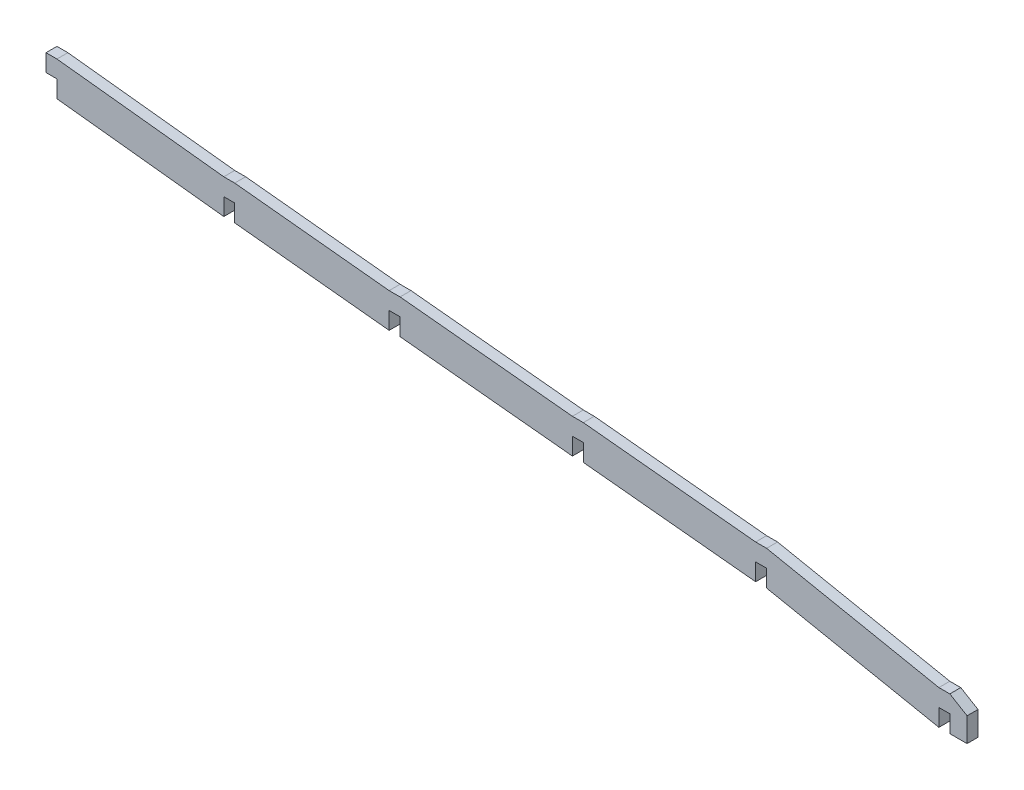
ISO-10303-21;
HEADER;
FILE_DESCRIPTION(('STEP AP214'),'2;1');
FILE_NAME('part.step','',(''),(''),'','','');
FILE_SCHEMA(('AUTOMOTIVE_DESIGN { 1 0 10303 214 1 1 1 1 }'));
ENDSEC;
DATA;
#1=APPLICATION_CONTEXT('core data for automotive mechanical design processes');
#2=APPLICATION_PROTOCOL_DEFINITION('international standard','automotive_design',2000,#1);
#3=PRODUCT_CONTEXT('',#1,'mechanical');
#4=PRODUCT('Part','Part','',(#3));
#5=PRODUCT_RELATED_PRODUCT_CATEGORY('part','',(#4));
#6=PRODUCT_DEFINITION_FORMATION('','',#4);
#7=PRODUCT_DEFINITION_CONTEXT('part definition',#1,'design');
#8=PRODUCT_DEFINITION('design','',#6,#7);
#9=PRODUCT_DEFINITION_SHAPE('','',#8);
#10=(LENGTH_UNIT() NAMED_UNIT(*) SI_UNIT(.MILLI.,.METRE.));
#11=(NAMED_UNIT(*) PLANE_ANGLE_UNIT() SI_UNIT($,.RADIAN.));
#12=(NAMED_UNIT(*) SI_UNIT($,.STERADIAN.) SOLID_ANGLE_UNIT());
#13=UNCERTAINTY_MEASURE_WITH_UNIT(LENGTH_MEASURE(1.E-05),#10,'distance_accuracy_value','');
#14=(GEOMETRIC_REPRESENTATION_CONTEXT(3) GLOBAL_UNCERTAINTY_ASSIGNED_CONTEXT((#13)) GLOBAL_UNIT_ASSIGNED_CONTEXT((#10,
#11,#12)) REPRESENTATION_CONTEXT('',''));
#15=CARTESIAN_POINT('',(0.,0.,0.));
#16=DIRECTION('',(0.,0.,1.));
#17=DIRECTION('',(1.,0.,0.));
#18=AXIS2_PLACEMENT_3D('',#15,#16,#17);
#19=CARTESIAN_POINT('',(0.,45.,3.175));
#20=DIRECTION('',(-1.,0.,0.));
#21=DIRECTION('',(0.,-1.,0.));
#22=AXIS2_PLACEMENT_3D('',#19,#20,#21);
#23=PLANE('',#22);
#24=DIRECTION('',(0.,1.,0.));
#25=VECTOR('',#24,1.);
#26=CARTESIAN_POINT('',(0.,45.,0.));
#27=LINE('',#26,#25);
#28=CARTESIAN_POINT('',(0.,40.,0.));
#29=VERTEX_POINT('',#28);
#30=CARTESIAN_POINT('',(0.,45.,0.));
#31=VERTEX_POINT('',#30);
#32=EDGE_CURVE('E303',#29,#31,#27,.T.);
#33=ORIENTED_EDGE('',*,*,#32,.T.);
#34=DIRECTION('',(0.,0.,-1.));
#35=VECTOR('',#34,1.);
#36=CARTESIAN_POINT('',(0.,45.,3.175));
#37=LINE('',#36,#35);
#38=CARTESIAN_POINT('',(0.,45.,3.175));
#39=VERTEX_POINT('',#38);
#40=EDGE_CURVE('E11',#39,#31,#37,.T.);
#41=ORIENTED_EDGE('',*,*,#40,.F.);
#42=DIRECTION('',(0.,1.,0.));
#43=VECTOR('',#42,1.);
#44=CARTESIAN_POINT('',(0.,45.,3.175));
#45=LINE('',#44,#43);
#46=CARTESIAN_POINT('',(0.,40.,3.175));
#47=VERTEX_POINT('',#46);
#48=EDGE_CURVE('E375',#47,#39,#45,.T.);
#49=ORIENTED_EDGE('',*,*,#48,.F.);
#50=DIRECTION('',(0.,0.,-1.));
#51=VECTOR('',#50,1.);
#52=CARTESIAN_POINT('',(0.,40.,3.175));
#53=LINE('',#52,#51);
#54=EDGE_CURVE('E299',#47,#29,#53,.T.);
#55=ORIENTED_EDGE('',*,*,#54,.T.);
#56=EDGE_LOOP('',(#33,#41,#49,#55));
#57=FACE_BOUND('',#56,.T.);
#58=ADVANCED_FACE('F33',(#57),#23,.F.);
#59=CARTESIAN_POINT('',(0.,45.,3.175));
#60=DIRECTION('',(0.,1.,0.));
#61=DIRECTION('',(0.,0.,1.));
#62=AXIS2_PLACEMENT_3D('',#59,#60,#61);
#63=PLANE('',#62);
#64=DIRECTION('',(1.,0.,0.));
#65=VECTOR('',#64,1.);
#66=CARTESIAN_POINT('',(0.,45.,0.));
#67=LINE('',#66,#65);
#68=CARTESIAN_POINT('',(3.175,45.,0.));
#69=VERTEX_POINT('',#68);
#70=EDGE_CURVE('E306',#31,#69,#67,.T.);
#71=ORIENTED_EDGE('',*,*,#70,.T.);
#72=DIRECTION('',(0.,0.,-1.));
#73=VECTOR('',#72,1.);
#74=CARTESIAN_POINT('',(3.175,45.,3.175));
#75=LINE('',#74,#73);
#76=CARTESIAN_POINT('',(3.175,45.,3.175));
#77=VERTEX_POINT('',#76);
#78=EDGE_CURVE('E41',#77,#69,#75,.T.);
#79=ORIENTED_EDGE('',*,*,#78,.F.);
#80=DIRECTION('',(1.,0.,0.));
#81=VECTOR('',#80,1.);
#82=CARTESIAN_POINT('',(0.,45.,3.175));
#83=LINE('',#82,#81);
#84=EDGE_CURVE('E179',#39,#77,#83,.T.);
#85=ORIENTED_EDGE('',*,*,#84,.F.);
#86=ORIENTED_EDGE('',*,*,#40,.T.);
#87=EDGE_LOOP('',(#71,#79,#85,#86));
#88=FACE_BOUND('',#87,.T.);
#89=ADVANCED_FACE('F578',(#88),#63,.F.);
#90=CARTESIAN_POINT('',(3.175,45.,3.175));
#91=DIRECTION('',(1.,0.,0.));
#92=DIRECTION('',(0.,0.,-1.));
#93=AXIS2_PLACEMENT_3D('',#90,#91,#92);
#94=PLANE('',#93);
#95=DIRECTION('',(0.,-1.,0.));
#96=VECTOR('',#95,1.);
#97=CARTESIAN_POINT('',(3.175,45.,0.));
#98=LINE('',#97,#96);
#99=CARTESIAN_POINT('',(3.175,40.,0.));
#100=VERTEX_POINT('',#99);
#101=EDGE_CURVE('E308',#69,#100,#98,.T.);
#102=ORIENTED_EDGE('',*,*,#101,.T.);
#103=DIRECTION('',(0.,0.,-1.));
#104=VECTOR('',#103,1.);
#105=CARTESIAN_POINT('',(3.175,40.,3.175));
#106=LINE('',#105,#104);
#107=CARTESIAN_POINT('',(3.175,40.,3.175));
#108=VERTEX_POINT('',#107);
#109=EDGE_CURVE('E469',#108,#100,#106,.T.);
#110=ORIENTED_EDGE('',*,*,#109,.F.);
#111=DIRECTION('',(0.,-1.,0.));
#112=VECTOR('',#111,1.);
#113=CARTESIAN_POINT('',(3.175,45.,3.175));
#114=LINE('',#113,#112);
#115=EDGE_CURVE('E477',#77,#108,#114,.T.);
#116=ORIENTED_EDGE('',*,*,#115,.F.);
#117=ORIENTED_EDGE('',*,*,#78,.T.);
#118=EDGE_LOOP('',(#102,#110,#116,#117));
#119=FACE_BOUND('',#118,.T.);
#120=ADVANCED_FACE('F475',(#119),#94,.F.);
#121=CARTESIAN_POINT('',(3.175,40.,3.175));
#122=DIRECTION('',(0.0995037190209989,0.995037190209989,0.));
#123=DIRECTION('',(-0.995037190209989,0.0995037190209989,0.));
#124=AXIS2_PLACEMENT_3D('',#121,#122,#123);
#125=PLANE('',#124);
#126=DIRECTION('',(0.995037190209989,-0.0995037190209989,0.));
#127=VECTOR('',#126,1.);
#128=CARTESIAN_POINT('',(3.175,40.,0.));
#129=LINE('',#128,#127);
#130=CARTESIAN_POINT('',(53.175,35.,0.));
#131=VERTEX_POINT('',#130);
#132=EDGE_CURVE('E310',#100,#131,#129,.T.);
#133=ORIENTED_EDGE('',*,*,#132,.T.);
#134=DIRECTION('',(0.,0.,-1.));
#135=VECTOR('',#134,1.);
#136=CARTESIAN_POINT('',(53.175,35.,3.175));
#137=LINE('',#136,#135);
#138=CARTESIAN_POINT('',(53.175,35.,3.175));
#139=VERTEX_POINT('',#138);
#140=EDGE_CURVE('E466',#139,#131,#137,.T.);
#141=ORIENTED_EDGE('',*,*,#140,.F.);
#142=DIRECTION('',(0.995037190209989,-0.0995037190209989,0.));
#143=VECTOR('',#142,1.);
#144=CARTESIAN_POINT('',(3.175,40.,3.175));
#145=LINE('',#144,#143);
#146=EDGE_CURVE('E495',#108,#139,#145,.T.);
#147=ORIENTED_EDGE('',*,*,#146,.F.);
#148=ORIENTED_EDGE('',*,*,#109,.T.);
#149=EDGE_LOOP('',(#133,#141,#147,#148));
#150=FACE_BOUND('',#149,.T.);
#151=ADVANCED_FACE('F486',(#150),#125,.F.);
#152=CARTESIAN_POINT('',(53.175,40.,3.175));
#153=DIRECTION('',(-1.,0.,0.));
#154=DIRECTION('',(0.,0.,1.));
#155=AXIS2_PLACEMENT_3D('',#152,#153,#154);
#156=PLANE('',#155);
#157=DIRECTION('',(0.,1.,0.));
#158=VECTOR('',#157,1.);
#159=CARTESIAN_POINT('',(53.175,40.,0.));
#160=LINE('',#159,#158);
#161=CARTESIAN_POINT('',(53.175,40.,0.));
#162=VERTEX_POINT('',#161);
#163=EDGE_CURVE('E312',#131,#162,#160,.T.);
#164=ORIENTED_EDGE('',*,*,#163,.T.);
#165=DIRECTION('',(0.,0.,-1.));
#166=VECTOR('',#165,1.);
#167=CARTESIAN_POINT('',(53.175,40.,3.175));
#168=LINE('',#167,#166);
#169=CARTESIAN_POINT('',(53.175,40.,3.175));
#170=VERTEX_POINT('',#169);
#171=EDGE_CURVE('E463',#170,#162,#168,.T.);
#172=ORIENTED_EDGE('',*,*,#171,.F.);
#173=DIRECTION('',(0.,1.,0.));
#174=VECTOR('',#173,1.);
#175=CARTESIAN_POINT('',(53.175,40.,3.175));
#176=LINE('',#175,#174);
#177=EDGE_CURVE('E492',#139,#170,#176,.T.);
#178=ORIENTED_EDGE('',*,*,#177,.F.);
#179=ORIENTED_EDGE('',*,*,#140,.T.);
#180=EDGE_LOOP('',(#164,#172,#178,#179));
#181=FACE_BOUND('',#180,.T.);
#182=ADVANCED_FACE('F490',(#181),#156,.F.);
#183=CARTESIAN_POINT('',(53.175,40.,3.175));
#184=DIRECTION('',(0.,1.,0.));
#185=DIRECTION('',(0.,0.,1.));
#186=AXIS2_PLACEMENT_3D('',#183,#184,#185);
#187=PLANE('',#186);
#188=DIRECTION('',(1.,0.,0.));
#189=VECTOR('',#188,1.);
#190=CARTESIAN_POINT('',(53.175,40.,0.));
#191=LINE('',#190,#189);
#192=CARTESIAN_POINT('',(56.35,40.,0.));
#193=VERTEX_POINT('',#192);
#194=EDGE_CURVE('E314',#162,#193,#191,.T.);
#195=ORIENTED_EDGE('',*,*,#194,.T.);
#196=DIRECTION('',(0.,0.,-1.));
#197=VECTOR('',#196,1.);
#198=CARTESIAN_POINT('',(56.35,40.,3.175));
#199=LINE('',#198,#197);
#200=CARTESIAN_POINT('',(56.35,40.,3.175));
#201=VERTEX_POINT('',#200);
#202=EDGE_CURVE('E460',#201,#193,#199,.T.);
#203=ORIENTED_EDGE('',*,*,#202,.F.);
#204=DIRECTION('',(1.,0.,0.));
#205=VECTOR('',#204,1.);
#206=CARTESIAN_POINT('',(53.175,40.,3.175));
#207=LINE('',#206,#205);
#208=EDGE_CURVE('E494',#170,#201,#207,.T.);
#209=ORIENTED_EDGE('',*,*,#208,.F.);
#210=ORIENTED_EDGE('',*,*,#171,.T.);
#211=EDGE_LOOP('',(#195,#203,#209,#210));
#212=FACE_BOUND('',#211,.T.);
#213=ADVANCED_FACE('F591',(#212),#187,.F.);
#214=CARTESIAN_POINT('',(56.35,40.,3.175));
#215=DIRECTION('',(1.,0.,0.));
#216=DIRECTION('',(0.,0.,-1.));
#217=AXIS2_PLACEMENT_3D('',#214,#215,#216);
#218=PLANE('',#217);
#219=DIRECTION('',(0.,-1.,0.));
#220=VECTOR('',#219,1.);
#221=CARTESIAN_POINT('',(56.35,40.,0.));
#222=LINE('',#221,#220);
#223=CARTESIAN_POINT('',(56.35,35.,0.));
#224=VERTEX_POINT('',#223);
#225=EDGE_CURVE('E316',#193,#224,#222,.T.);
#226=ORIENTED_EDGE('',*,*,#225,.T.);
#227=DIRECTION('',(0.,0.,-1.));
#228=VECTOR('',#227,1.);
#229=CARTESIAN_POINT('',(56.35,35.,3.175));
#230=LINE('',#229,#228);
#231=CARTESIAN_POINT('',(56.35,35.,3.175));
#232=VERTEX_POINT('',#231);
#233=EDGE_CURVE('E457',#232,#224,#230,.T.);
#234=ORIENTED_EDGE('',*,*,#233,.F.);
#235=DIRECTION('',(0.,-1.,0.));
#236=VECTOR('',#235,1.);
#237=CARTESIAN_POINT('',(56.35,40.,3.175));
#238=LINE('',#237,#236);
#239=EDGE_CURVE('E497',#201,#232,#238,.T.);
#240=ORIENTED_EDGE('',*,*,#239,.F.);
#241=ORIENTED_EDGE('',*,*,#202,.T.);
#242=EDGE_LOOP('',(#226,#234,#240,#241));
#243=FACE_BOUND('',#242,.T.);
#244=ADVANCED_FACE('F594',(#243),#218,.F.);
#245=CARTESIAN_POINT('',(56.35,35.,3.175));
#246=DIRECTION('',(0.0995037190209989,0.995037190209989,0.));
#247=DIRECTION('',(-0.995037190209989,0.0995037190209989,0.));
#248=AXIS2_PLACEMENT_3D('',#245,#246,#247);
#249=PLANE('',#248);
#250=DIRECTION('',(0.995037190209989,-0.0995037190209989,0.));
#251=VECTOR('',#250,1.);
#252=CARTESIAN_POINT('',(56.35,35.,0.));
#253=LINE('',#252,#251);
#254=CARTESIAN_POINT('',(106.35,30.,0.));
#255=VERTEX_POINT('',#254);
#256=EDGE_CURVE('E318',#224,#255,#253,.T.);
#257=ORIENTED_EDGE('',*,*,#256,.T.);
#258=DIRECTION('',(0.,0.,-1.));
#259=VECTOR('',#258,1.);
#260=CARTESIAN_POINT('',(106.35,30.,3.175));
#261=LINE('',#260,#259);
#262=CARTESIAN_POINT('',(106.35,30.,3.175));
#263=VERTEX_POINT('',#262);
#264=EDGE_CURVE('E454',#263,#255,#261,.T.);
#265=ORIENTED_EDGE('',*,*,#264,.F.);
#266=DIRECTION('',(0.995037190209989,-0.0995037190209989,0.));
#267=VECTOR('',#266,1.);
#268=CARTESIAN_POINT('',(56.35,35.,3.175));
#269=LINE('',#268,#267);
#270=EDGE_CURVE('E503',#232,#263,#269,.T.);
#271=ORIENTED_EDGE('',*,*,#270,.F.);
#272=ORIENTED_EDGE('',*,*,#233,.T.);
#273=EDGE_LOOP('',(#257,#265,#271,#272));
#274=FACE_BOUND('',#273,.T.);
#275=ADVANCED_FACE('F598',(#274),#249,.F.);
#276=CARTESIAN_POINT('',(106.35,30.,3.175));
#277=DIRECTION('',(-1.,0.,0.));
#278=DIRECTION('',(0.,0.,1.));
#279=AXIS2_PLACEMENT_3D('',#276,#277,#278);
#280=PLANE('',#279);
#281=DIRECTION('',(0.,1.,0.));
#282=VECTOR('',#281,1.);
#283=CARTESIAN_POINT('',(106.35,30.,0.));
#284=LINE('',#283,#282);
#285=CARTESIAN_POINT('',(106.35,35.,0.));
#286=VERTEX_POINT('',#285);
#287=EDGE_CURVE('E320',#255,#286,#284,.T.);
#288=ORIENTED_EDGE('',*,*,#287,.T.);
#289=DIRECTION('',(0.,0.,-1.));
#290=VECTOR('',#289,1.);
#291=CARTESIAN_POINT('',(106.35,35.,3.175));
#292=LINE('',#291,#290);
#293=CARTESIAN_POINT('',(106.35,35.,3.175));
#294=VERTEX_POINT('',#293);
#295=EDGE_CURVE('E451',#294,#286,#292,.T.);
#296=ORIENTED_EDGE('',*,*,#295,.F.);
#297=DIRECTION('',(0.,1.,0.));
#298=VECTOR('',#297,1.);
#299=CARTESIAN_POINT('',(106.35,30.,3.175));
#300=LINE('',#299,#298);
#301=EDGE_CURVE('E505',#263,#294,#300,.T.);
#302=ORIENTED_EDGE('',*,*,#301,.F.);
#303=ORIENTED_EDGE('',*,*,#264,.T.);
#304=EDGE_LOOP('',(#288,#296,#302,#303));
#305=FACE_BOUND('',#304,.T.);
#306=ADVANCED_FACE('F602',(#305),#280,.F.);
#307=CARTESIAN_POINT('',(106.35,35.,3.175));
#308=DIRECTION('',(0.,1.,0.));
#309=DIRECTION('',(0.,0.,1.));
#310=AXIS2_PLACEMENT_3D('',#307,#308,#309);
#311=PLANE('',#310);
#312=DIRECTION('',(1.,0.,0.));
#313=VECTOR('',#312,1.);
#314=CARTESIAN_POINT('',(106.35,35.,0.));
#315=LINE('',#314,#313);
#316=CARTESIAN_POINT('',(109.525,35.,0.));
#317=VERTEX_POINT('',#316);
#318=EDGE_CURVE('E322',#286,#317,#315,.T.);
#319=ORIENTED_EDGE('',*,*,#318,.T.);
#320=DIRECTION('',(0.,0.,-1.));
#321=VECTOR('',#320,1.);
#322=CARTESIAN_POINT('',(109.525,35.,3.175));
#323=LINE('',#322,#321);
#324=CARTESIAN_POINT('',(109.525,35.,3.175));
#325=VERTEX_POINT('',#324);
#326=EDGE_CURVE('E448',#325,#317,#323,.T.);
#327=ORIENTED_EDGE('',*,*,#326,.F.);
#328=DIRECTION('',(1.,0.,0.));
#329=VECTOR('',#328,1.);
#330=CARTESIAN_POINT('',(106.35,35.,3.175));
#331=LINE('',#330,#329);
#332=EDGE_CURVE('E507',#294,#325,#331,.T.);
#333=ORIENTED_EDGE('',*,*,#332,.F.);
#334=ORIENTED_EDGE('',*,*,#295,.T.);
#335=EDGE_LOOP('',(#319,#327,#333,#334));
#336=FACE_BOUND('',#335,.T.);
#337=ADVANCED_FACE('F606',(#336),#311,.F.);
#338=CARTESIAN_POINT('',(109.525,35.,3.175));
#339=DIRECTION('',(1.,0.,0.));
#340=DIRECTION('',(0.,0.,-1.));
#341=AXIS2_PLACEMENT_3D('',#338,#339,#340);
#342=PLANE('',#341);
#343=DIRECTION('',(0.,-1.,0.));
#344=VECTOR('',#343,1.);
#345=CARTESIAN_POINT('',(109.525,35.,0.));
#346=LINE('',#345,#344);
#347=CARTESIAN_POINT('',(109.525,30.,0.));
#348=VERTEX_POINT('',#347);
#349=EDGE_CURVE('E324',#317,#348,#346,.T.);
#350=ORIENTED_EDGE('',*,*,#349,.T.);
#351=DIRECTION('',(0.,0.,-1.));
#352=VECTOR('',#351,1.);
#353=CARTESIAN_POINT('',(109.525,30.,3.175));
#354=LINE('',#353,#352);
#355=CARTESIAN_POINT('',(109.525,30.,3.175));
#356=VERTEX_POINT('',#355);
#357=EDGE_CURVE('E445',#356,#348,#354,.T.);
#358=ORIENTED_EDGE('',*,*,#357,.F.);
#359=DIRECTION('',(0.,-1.,0.));
#360=VECTOR('',#359,1.);
#361=CARTESIAN_POINT('',(109.525,35.,3.175));
#362=LINE('',#361,#360);
#363=EDGE_CURVE('E509',#325,#356,#362,.T.);
#364=ORIENTED_EDGE('',*,*,#363,.F.);
#365=ORIENTED_EDGE('',*,*,#326,.T.);
#366=EDGE_LOOP('',(#350,#358,#364,#365));
#367=FACE_BOUND('',#366,.T.);
#368=ADVANCED_FACE('F610',(#367),#342,.F.);
#369=CARTESIAN_POINT('',(109.525,30.,3.175));
#370=DIRECTION('',(0.196116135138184,0.98058067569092,0.));
#371=DIRECTION('',(-0.98058067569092,0.196116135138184,0.));
#372=AXIS2_PLACEMENT_3D('',#369,#370,#371);
#373=PLANE('',#372);
#374=DIRECTION('',(0.98058067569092,-0.196116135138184,0.));
#375=VECTOR('',#374,1.);
#376=CARTESIAN_POINT('',(109.525,30.,0.));
#377=LINE('',#376,#375);
#378=CARTESIAN_POINT('',(159.525,20.,0.));
#379=VERTEX_POINT('',#378);
#380=EDGE_CURVE('E326',#348,#379,#377,.T.);
#381=ORIENTED_EDGE('',*,*,#380,.T.);
#382=DIRECTION('',(0.,0.,-1.));
#383=VECTOR('',#382,1.);
#384=CARTESIAN_POINT('',(159.525,20.,3.175));
#385=LINE('',#384,#383);
#386=CARTESIAN_POINT('',(159.525,20.,3.175));
#387=VERTEX_POINT('',#386);
#388=EDGE_CURVE('E442',#387,#379,#385,.T.);
#389=ORIENTED_EDGE('',*,*,#388,.F.);
#390=DIRECTION('',(0.98058067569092,-0.196116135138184,0.));
#391=VECTOR('',#390,1.);
#392=CARTESIAN_POINT('',(109.525,30.,3.175));
#393=LINE('',#392,#391);
#394=EDGE_CURVE('E511',#356,#387,#393,.T.);
#395=ORIENTED_EDGE('',*,*,#394,.F.);
#396=ORIENTED_EDGE('',*,*,#357,.T.);
#397=EDGE_LOOP('',(#381,#389,#395,#396));
#398=FACE_BOUND('',#397,.T.);
#399=ADVANCED_FACE('F614',(#398),#373,.F.);
#400=CARTESIAN_POINT('',(159.525,20.,3.175));
#401=DIRECTION('',(-1.,0.,0.));
#402=DIRECTION('',(0.,0.,1.));
#403=AXIS2_PLACEMENT_3D('',#400,#401,#402);
#404=PLANE('',#403);
#405=DIRECTION('',(0.,1.,0.));
#406=VECTOR('',#405,1.);
#407=CARTESIAN_POINT('',(159.525,20.,0.));
#408=LINE('',#407,#406);
#409=CARTESIAN_POINT('',(159.525,25.,0.));
#410=VERTEX_POINT('',#409);
#411=EDGE_CURVE('E328',#379,#410,#408,.T.);
#412=ORIENTED_EDGE('',*,*,#411,.T.);
#413=DIRECTION('',(0.,0.,-1.));
#414=VECTOR('',#413,1.);
#415=CARTESIAN_POINT('',(159.525,25.,3.175));
#416=LINE('',#415,#414);
#417=CARTESIAN_POINT('',(159.525,25.,3.175));
#418=VERTEX_POINT('',#417);
#419=EDGE_CURVE('E439',#418,#410,#416,.T.);
#420=ORIENTED_EDGE('',*,*,#419,.F.);
#421=DIRECTION('',(0.,1.,0.));
#422=VECTOR('',#421,1.);
#423=CARTESIAN_POINT('',(159.525,20.,3.175));
#424=LINE('',#423,#422);
#425=EDGE_CURVE('E513',#387,#418,#424,.T.);
#426=ORIENTED_EDGE('',*,*,#425,.F.);
#427=ORIENTED_EDGE('',*,*,#388,.T.);
#428=EDGE_LOOP('',(#412,#420,#426,#427));
#429=FACE_BOUND('',#428,.T.);
#430=ADVANCED_FACE('F618',(#429),#404,.F.);
#431=CARTESIAN_POINT('',(159.525,25.,3.175));
#432=DIRECTION('',(0.,1.,0.));
#433=DIRECTION('',(0.,0.,1.));
#434=AXIS2_PLACEMENT_3D('',#431,#432,#433);
#435=PLANE('',#434);
#436=DIRECTION('',(1.,0.,0.));
#437=VECTOR('',#436,1.);
#438=CARTESIAN_POINT('',(159.525,25.,0.));
#439=LINE('',#438,#437);
#440=CARTESIAN_POINT('',(162.7,25.,0.));
#441=VERTEX_POINT('',#440);
#442=EDGE_CURVE('E330',#410,#441,#439,.T.);
#443=ORIENTED_EDGE('',*,*,#442,.T.);
#444=DIRECTION('',(0.,0.,-1.));
#445=VECTOR('',#444,1.);
#446=CARTESIAN_POINT('',(162.7,25.,3.175));
#447=LINE('',#446,#445);
#448=CARTESIAN_POINT('',(162.7,25.,3.175));
#449=VERTEX_POINT('',#448);
#450=EDGE_CURVE('E436',#449,#441,#447,.T.);
#451=ORIENTED_EDGE('',*,*,#450,.F.);
#452=DIRECTION('',(1.,0.,0.));
#453=VECTOR('',#452,1.);
#454=CARTESIAN_POINT('',(159.525,25.,3.175));
#455=LINE('',#454,#453);
#456=EDGE_CURVE('E515',#418,#449,#455,.T.);
#457=ORIENTED_EDGE('',*,*,#456,.F.);
#458=ORIENTED_EDGE('',*,*,#419,.T.);
#459=EDGE_LOOP('',(#443,#451,#457,#458));
#460=FACE_BOUND('',#459,.T.);
#461=ADVANCED_FACE('F622',(#460),#435,.F.);
#462=CARTESIAN_POINT('',(162.7,25.,3.175));
#463=DIRECTION('',(1.,0.,0.));
#464=DIRECTION('',(0.,0.,-1.));
#465=AXIS2_PLACEMENT_3D('',#462,#463,#464);
#466=PLANE('',#465);
#467=DIRECTION('',(0.,-1.,0.));
#468=VECTOR('',#467,1.);
#469=CARTESIAN_POINT('',(162.7,25.,0.));
#470=LINE('',#469,#468);
#471=CARTESIAN_POINT('',(162.7,20.,0.));
#472=VERTEX_POINT('',#471);
#473=EDGE_CURVE('E332',#441,#472,#470,.T.);
#474=ORIENTED_EDGE('',*,*,#473,.T.);
#475=DIRECTION('',(0.,0.,-1.));
#476=VECTOR('',#475,1.);
#477=CARTESIAN_POINT('',(162.7,20.,3.175));
#478=LINE('',#477,#476);
#479=CARTESIAN_POINT('',(162.7,20.,3.175));
#480=VERTEX_POINT('',#479);
#481=EDGE_CURVE('E433',#480,#472,#478,.T.);
#482=ORIENTED_EDGE('',*,*,#481,.F.);
#483=DIRECTION('',(0.,-1.,0.));
#484=VECTOR('',#483,1.);
#485=CARTESIAN_POINT('',(162.7,25.,3.175));
#486=LINE('',#485,#484);
#487=EDGE_CURVE('E517',#449,#480,#486,.T.);
#488=ORIENTED_EDGE('',*,*,#487,.F.);
#489=ORIENTED_EDGE('',*,*,#450,.T.);
#490=EDGE_LOOP('',(#474,#482,#488,#489));
#491=FACE_BOUND('',#490,.T.);
#492=ADVANCED_FACE('F626',(#491),#466,.F.);
#493=CARTESIAN_POINT('',(162.7,20.,3.175));
#494=DIRECTION('',(0.,1.,0.));
#495=DIRECTION('',(0.,0.,1.));
#496=AXIS2_PLACEMENT_3D('',#493,#494,#495);
#497=PLANE('',#496);
#498=DIRECTION('',(1.,0.,0.));
#499=VECTOR('',#498,1.);
#500=CARTESIAN_POINT('',(162.7,20.,0.));
#501=LINE('',#500,#499);
#502=CARTESIAN_POINT('',(167.7,20.,0.));
#503=VERTEX_POINT('',#502);
#504=EDGE_CURVE('E334',#472,#503,#501,.T.);
#505=ORIENTED_EDGE('',*,*,#504,.T.);
#506=DIRECTION('',(0.,0.,-1.));
#507=VECTOR('',#506,1.);
#508=CARTESIAN_POINT('',(167.7,20.,3.175));
#509=LINE('',#508,#507);
#510=CARTESIAN_POINT('',(167.7,20.,3.175));
#511=VERTEX_POINT('',#510);
#512=EDGE_CURVE('E430',#511,#503,#509,.T.);
#513=ORIENTED_EDGE('',*,*,#512,.F.);
#514=DIRECTION('',(1.,0.,0.));
#515=VECTOR('',#514,1.);
#516=CARTESIAN_POINT('',(162.7,20.,3.175));
#517=LINE('',#516,#515);
#518=EDGE_CURVE('E519',#480,#511,#517,.T.);
#519=ORIENTED_EDGE('',*,*,#518,.F.);
#520=ORIENTED_EDGE('',*,*,#481,.T.);
#521=EDGE_LOOP('',(#505,#513,#519,#520));
#522=FACE_BOUND('',#521,.T.);
#523=ADVANCED_FACE('F630',(#522),#497,.F.);
#524=CARTESIAN_POINT('',(167.7,20.,3.175));
#525=DIRECTION('',(-1.,0.,0.));
#526=DIRECTION('',(0.,0.,1.));
#527=AXIS2_PLACEMENT_3D('',#524,#525,#526);
#528=PLANE('',#527);
#529=DIRECTION('',(0.,1.,0.));
#530=VECTOR('',#529,1.);
#531=CARTESIAN_POINT('',(167.7,20.,0.));
#532=LINE('',#531,#530);
#533=CARTESIAN_POINT('',(167.7,27.,0.));
#534=VERTEX_POINT('',#533);
#535=EDGE_CURVE('E336',#503,#534,#532,.T.);
#536=ORIENTED_EDGE('',*,*,#535,.T.);
#537=DIRECTION('',(0.,0.,-1.));
#538=VECTOR('',#537,1.);
#539=CARTESIAN_POINT('',(167.7,27.,3.175));
#540=LINE('',#539,#538);
#541=CARTESIAN_POINT('',(167.7,27.,3.175));
#542=VERTEX_POINT('',#541);
#543=EDGE_CURVE('E427',#542,#534,#540,.T.);
#544=ORIENTED_EDGE('',*,*,#543,.F.);
#545=DIRECTION('',(0.,1.,0.));
#546=VECTOR('',#545,1.);
#547=CARTESIAN_POINT('',(167.7,20.,3.175));
#548=LINE('',#547,#546);
#549=EDGE_CURVE('E521',#511,#542,#548,.T.);
#550=ORIENTED_EDGE('',*,*,#549,.F.);
#551=ORIENTED_EDGE('',*,*,#512,.T.);
#552=EDGE_LOOP('',(#536,#544,#550,#551));
#553=FACE_BOUND('',#552,.T.);
#554=ADVANCED_FACE('F634',(#553),#528,.F.);
#555=CARTESIAN_POINT('',(162.7,30.,3.175));
#556=DIRECTION('',(-0.514495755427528,-0.857492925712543,0.));
#557=DIRECTION('',(0.857492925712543,-0.514495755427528,0.));
#558=AXIS2_PLACEMENT_3D('',#555,#556,#557);
#559=PLANE('',#558);
#560=DIRECTION('',(-0.857492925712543,0.514495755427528,0.));
#561=VECTOR('',#560,1.);
#562=CARTESIAN_POINT('',(162.7,30.,0.));
#563=LINE('',#562,#561);
#564=CARTESIAN_POINT('',(162.7,30.,0.));
#565=VERTEX_POINT('',#564);
#566=EDGE_CURVE('E338',#534,#565,#563,.T.);
#567=ORIENTED_EDGE('',*,*,#566,.T.);
#568=DIRECTION('',(0.,0.,-1.));
#569=VECTOR('',#568,1.);
#570=CARTESIAN_POINT('',(162.7,30.,3.175));
#571=LINE('',#570,#569);
#572=CARTESIAN_POINT('',(162.7,30.,3.175));
#573=VERTEX_POINT('',#572);
#574=EDGE_CURVE('E424',#573,#565,#571,.T.);
#575=ORIENTED_EDGE('',*,*,#574,.F.);
#576=DIRECTION('',(-0.857492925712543,0.514495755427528,0.));
#577=VECTOR('',#576,1.);
#578=CARTESIAN_POINT('',(162.7,30.,3.175));
#579=LINE('',#578,#577);
#580=EDGE_CURVE('E523',#542,#573,#579,.T.);
#581=ORIENTED_EDGE('',*,*,#580,.F.);
#582=ORIENTED_EDGE('',*,*,#543,.T.);
#583=EDGE_LOOP('',(#567,#575,#581,#582));
#584=FACE_BOUND('',#583,.T.);
#585=ADVANCED_FACE('F638',(#584),#559,.F.);
#586=CARTESIAN_POINT('',(159.525,30.,3.175));
#587=DIRECTION('',(0.,-1.,0.));
#588=DIRECTION('',(0.,0.,-1.));
#589=AXIS2_PLACEMENT_3D('',#586,#587,#588);
#590=PLANE('',#589);
#591=DIRECTION('',(-1.,0.,0.));
#592=VECTOR('',#591,1.);
#593=CARTESIAN_POINT('',(159.525,30.,0.));
#594=LINE('',#593,#592);
#595=CARTESIAN_POINT('',(159.525,30.,0.));
#596=VERTEX_POINT('',#595);
#597=EDGE_CURVE('E340',#565,#596,#594,.T.);
#598=ORIENTED_EDGE('',*,*,#597,.T.);
#599=DIRECTION('',(0.,0.,-1.));
#600=VECTOR('',#599,1.);
#601=CARTESIAN_POINT('',(159.525,30.,3.175));
#602=LINE('',#601,#600);
#603=CARTESIAN_POINT('',(159.525,30.,3.175));
#604=VERTEX_POINT('',#603);
#605=EDGE_CURVE('E421',#604,#596,#602,.T.);
#606=ORIENTED_EDGE('',*,*,#605,.F.);
#607=DIRECTION('',(-1.,0.,0.));
#608=VECTOR('',#607,1.);
#609=CARTESIAN_POINT('',(159.525,30.,3.175));
#610=LINE('',#609,#608);
#611=EDGE_CURVE('E525',#573,#604,#610,.T.);
#612=ORIENTED_EDGE('',*,*,#611,.F.);
#613=ORIENTED_EDGE('',*,*,#574,.T.);
#614=EDGE_LOOP('',(#598,#606,#612,#613));
#615=FACE_BOUND('',#614,.T.);
#616=ADVANCED_FACE('F642',(#615),#590,.F.);
#617=CARTESIAN_POINT('',(109.525,40.,3.175));
#618=DIRECTION('',(-0.196116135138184,-0.98058067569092,0.));
#619=DIRECTION('',(0.98058067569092,-0.196116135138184,0.));
#620=AXIS2_PLACEMENT_3D('',#617,#618,#619);
#621=PLANE('',#620);
#622=DIRECTION('',(-0.98058067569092,0.196116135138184,0.));
#623=VECTOR('',#622,1.);
#624=CARTESIAN_POINT('',(109.525,40.,0.));
#625=LINE('',#624,#623);
#626=CARTESIAN_POINT('',(109.525,40.,0.));
#627=VERTEX_POINT('',#626);
#628=EDGE_CURVE('E342',#596,#627,#625,.T.);
#629=ORIENTED_EDGE('',*,*,#628,.T.);
#630=DIRECTION('',(0.,0.,-1.));
#631=VECTOR('',#630,1.);
#632=CARTESIAN_POINT('',(109.525,40.,3.175));
#633=LINE('',#632,#631);
#634=CARTESIAN_POINT('',(109.525,40.,3.175));
#635=VERTEX_POINT('',#634);
#636=EDGE_CURVE('E418',#635,#627,#633,.T.);
#637=ORIENTED_EDGE('',*,*,#636,.F.);
#638=DIRECTION('',(-0.98058067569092,0.196116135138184,0.));
#639=VECTOR('',#638,1.);
#640=CARTESIAN_POINT('',(109.525,40.,3.175));
#641=LINE('',#640,#639);
#642=EDGE_CURVE('E527',#604,#635,#641,.T.);
#643=ORIENTED_EDGE('',*,*,#642,.F.);
#644=ORIENTED_EDGE('',*,*,#605,.T.);
#645=EDGE_LOOP('',(#629,#637,#643,#644));
#646=FACE_BOUND('',#645,.T.);
#647=ADVANCED_FACE('F646',(#646),#621,.F.);
#648=CARTESIAN_POINT('',(106.35,40.,3.175));
#649=DIRECTION('',(0.,-1.,0.));
#650=DIRECTION('',(0.,0.,-1.));
#651=AXIS2_PLACEMENT_3D('',#648,#649,#650);
#652=PLANE('',#651);
#653=DIRECTION('',(-1.,0.,0.));
#654=VECTOR('',#653,1.);
#655=CARTESIAN_POINT('',(106.35,40.,0.));
#656=LINE('',#655,#654);
#657=CARTESIAN_POINT('',(106.35,40.,0.));
#658=VERTEX_POINT('',#657);
#659=EDGE_CURVE('E344',#627,#658,#656,.T.);
#660=ORIENTED_EDGE('',*,*,#659,.T.);
#661=DIRECTION('',(0.,0.,-1.));
#662=VECTOR('',#661,1.);
#663=CARTESIAN_POINT('',(106.35,40.,3.175));
#664=LINE('',#663,#662);
#665=CARTESIAN_POINT('',(106.35,40.,3.175));
#666=VERTEX_POINT('',#665);
#667=EDGE_CURVE('E415',#666,#658,#664,.T.);
#668=ORIENTED_EDGE('',*,*,#667,.F.);
#669=DIRECTION('',(-1.,0.,0.));
#670=VECTOR('',#669,1.);
#671=CARTESIAN_POINT('',(106.35,40.,3.175));
#672=LINE('',#671,#670);
#673=EDGE_CURVE('E529',#635,#666,#672,.T.);
#674=ORIENTED_EDGE('',*,*,#673,.F.);
#675=ORIENTED_EDGE('',*,*,#636,.T.);
#676=EDGE_LOOP('',(#660,#668,#674,#675));
#677=FACE_BOUND('',#676,.T.);
#678=ADVANCED_FACE('F650',(#677),#652,.F.);
#679=CARTESIAN_POINT('',(56.35,45.,3.175));
#680=DIRECTION('',(-0.0995037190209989,-0.995037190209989,0.));
#681=DIRECTION('',(0.995037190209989,-0.0995037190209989,0.));
#682=AXIS2_PLACEMENT_3D('',#679,#680,#681);
#683=PLANE('',#682);
#684=DIRECTION('',(-0.995037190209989,0.0995037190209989,0.));
#685=VECTOR('',#684,1.);
#686=CARTESIAN_POINT('',(56.35,45.,0.));
#687=LINE('',#686,#685);
#688=CARTESIAN_POINT('',(56.35,45.,0.));
#689=VERTEX_POINT('',#688);
#690=EDGE_CURVE('E346',#658,#689,#687,.T.);
#691=ORIENTED_EDGE('',*,*,#690,.T.);
#692=DIRECTION('',(0.,0.,-1.));
#693=VECTOR('',#692,1.);
#694=CARTESIAN_POINT('',(56.35,45.,3.175));
#695=LINE('',#694,#693);
#696=CARTESIAN_POINT('',(56.35,45.,3.175));
#697=VERTEX_POINT('',#696);
#698=EDGE_CURVE('E412',#697,#689,#695,.T.);
#699=ORIENTED_EDGE('',*,*,#698,.F.);
#700=DIRECTION('',(-0.995037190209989,0.0995037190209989,0.));
#701=VECTOR('',#700,1.);
#702=CARTESIAN_POINT('',(56.35,45.,3.175));
#703=LINE('',#702,#701);
#704=EDGE_CURVE('E531',#666,#697,#703,.T.);
#705=ORIENTED_EDGE('',*,*,#704,.F.);
#706=ORIENTED_EDGE('',*,*,#667,.T.);
#707=EDGE_LOOP('',(#691,#699,#705,#706));
#708=FACE_BOUND('',#707,.T.);
#709=ADVANCED_FACE('F654',(#708),#683,.F.);
#710=CARTESIAN_POINT('',(53.175,45.,3.175));
#711=DIRECTION('',(0.,-1.,0.));
#712=DIRECTION('',(0.,0.,-1.));
#713=AXIS2_PLACEMENT_3D('',#710,#711,#712);
#714=PLANE('',#713);
#715=DIRECTION('',(-1.,0.,0.));
#716=VECTOR('',#715,1.);
#717=CARTESIAN_POINT('',(53.175,45.,0.));
#718=LINE('',#717,#716);
#719=CARTESIAN_POINT('',(53.175,45.,0.));
#720=VERTEX_POINT('',#719);
#721=EDGE_CURVE('E348',#689,#720,#718,.T.);
#722=ORIENTED_EDGE('',*,*,#721,.T.);
#723=DIRECTION('',(0.,0.,-1.));
#724=VECTOR('',#723,1.);
#725=CARTESIAN_POINT('',(53.175,45.,3.175));
#726=LINE('',#725,#724);
#727=CARTESIAN_POINT('',(53.175,45.,3.175));
#728=VERTEX_POINT('',#727);
#729=EDGE_CURVE('E409',#728,#720,#726,.T.);
#730=ORIENTED_EDGE('',*,*,#729,.F.);
#731=DIRECTION('',(-1.,0.,0.));
#732=VECTOR('',#731,1.);
#733=CARTESIAN_POINT('',(53.175,45.,3.175));
#734=LINE('',#733,#732);
#735=EDGE_CURVE('E533',#697,#728,#734,.T.);
#736=ORIENTED_EDGE('',*,*,#735,.F.);
#737=ORIENTED_EDGE('',*,*,#698,.T.);
#738=EDGE_LOOP('',(#722,#730,#736,#737));
#739=FACE_BOUND('',#738,.T.);
#740=ADVANCED_FACE('F658',(#739),#714,.F.);
#741=CARTESIAN_POINT('',(3.175,50.,3.175));
#742=DIRECTION('',(-0.0995037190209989,-0.995037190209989,0.));
#743=DIRECTION('',(0.995037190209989,-0.0995037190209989,0.));
#744=AXIS2_PLACEMENT_3D('',#741,#742,#743);
#745=PLANE('',#744);
#746=DIRECTION('',(-0.995037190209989,0.0995037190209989,0.));
#747=VECTOR('',#746,1.);
#748=CARTESIAN_POINT('',(3.175,50.,0.));
#749=LINE('',#748,#747);
#750=CARTESIAN_POINT('',(3.175,50.,0.));
#751=VERTEX_POINT('',#750);
#752=EDGE_CURVE('E350',#720,#751,#749,.T.);
#753=ORIENTED_EDGE('',*,*,#752,.T.);
#754=DIRECTION('',(0.,0.,-1.));
#755=VECTOR('',#754,1.);
#756=CARTESIAN_POINT('',(3.175,50.,3.175));
#757=LINE('',#756,#755);
#758=CARTESIAN_POINT('',(3.175,50.,3.175));
#759=VERTEX_POINT('',#758);
#760=EDGE_CURVE('E406',#759,#751,#757,.T.);
#761=ORIENTED_EDGE('',*,*,#760,.F.);
#762=DIRECTION('',(-0.995037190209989,0.0995037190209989,0.));
#763=VECTOR('',#762,1.);
#764=CARTESIAN_POINT('',(3.175,50.,3.175));
#765=LINE('',#764,#763);
#766=EDGE_CURVE('E535',#728,#759,#765,.T.);
#767=ORIENTED_EDGE('',*,*,#766,.F.);
#768=ORIENTED_EDGE('',*,*,#729,.T.);
#769=EDGE_LOOP('',(#753,#761,#767,#768));
#770=FACE_BOUND('',#769,.T.);
#771=ADVANCED_FACE('F662',(#770),#745,.F.);
#772=CARTESIAN_POINT('',(0.,50.,3.175));
#773=DIRECTION('',(0.,-1.,0.));
#774=DIRECTION('',(0.,0.,-1.));
#775=AXIS2_PLACEMENT_3D('',#772,#773,#774);
#776=PLANE('',#775);
#777=DIRECTION('',(-1.,0.,0.));
#778=VECTOR('',#777,1.);
#779=CARTESIAN_POINT('',(0.,50.,0.));
#780=LINE('',#779,#778);
#781=CARTESIAN_POINT('',(0.,50.,0.));
#782=VERTEX_POINT('',#781);
#783=EDGE_CURVE('E352',#751,#782,#780,.T.);
#784=ORIENTED_EDGE('',*,*,#783,.T.);
#785=DIRECTION('',(0.,0.,-1.));
#786=VECTOR('',#785,1.);
#787=CARTESIAN_POINT('',(0.,50.,3.175));
#788=LINE('',#787,#786);
#789=CARTESIAN_POINT('',(0.,50.,3.175));
#790=VERTEX_POINT('',#789);
#791=EDGE_CURVE('E403',#790,#782,#788,.T.);
#792=ORIENTED_EDGE('',*,*,#791,.F.);
#793=DIRECTION('',(-1.,0.,0.));
#794=VECTOR('',#793,1.);
#795=CARTESIAN_POINT('',(0.,50.,3.175));
#796=LINE('',#795,#794);
#797=EDGE_CURVE('E537',#759,#790,#796,.T.);
#798=ORIENTED_EDGE('',*,*,#797,.F.);
#799=ORIENTED_EDGE('',*,*,#760,.T.);
#800=EDGE_LOOP('',(#784,#792,#798,#799));
#801=FACE_BOUND('',#800,.T.);
#802=ADVANCED_FACE('F666',(#801),#776,.F.);
#803=CARTESIAN_POINT('',(0.,50.,3.175));
#804=DIRECTION('',(-0.102382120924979,-0.994745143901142,0.));
#805=DIRECTION('',(0.994745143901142,-0.102382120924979,0.));
#806=AXIS2_PLACEMENT_3D('',#803,#804,#805);
#807=PLANE('',#806);
#808=DIRECTION('',(-0.994745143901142,0.102382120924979,0.));
#809=VECTOR('',#808,1.);
#810=CARTESIAN_POINT('',(0.,50.,0.));
#811=LINE('',#810,#809);
#812=CARTESIAN_POINT('',(-44.81,54.61197812,0.));
#813=VERTEX_POINT('',#812);
#814=EDGE_CURVE('E354',#782,#813,#811,.T.);
#815=ORIENTED_EDGE('',*,*,#814,.T.);
#816=DIRECTION('',(0.,0.,-1.));
#817=VECTOR('',#816,1.);
#818=CARTESIAN_POINT('',(-44.81,54.61197812,3.175));
#819=LINE('',#818,#817);
#820=CARTESIAN_POINT('',(-44.81,54.61197812,3.175));
#821=VERTEX_POINT('',#820);
#822=EDGE_CURVE('E400',#821,#813,#819,.T.);
#823=ORIENTED_EDGE('',*,*,#822,.F.);
#824=DIRECTION('',(-0.994745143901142,0.102382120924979,0.));
#825=VECTOR('',#824,1.);
#826=CARTESIAN_POINT('',(0.,50.,3.175));
#827=LINE('',#826,#825);
#828=EDGE_CURVE('E539',#790,#821,#827,.T.);
#829=ORIENTED_EDGE('',*,*,#828,.F.);
#830=ORIENTED_EDGE('',*,*,#791,.T.);
#831=EDGE_LOOP('',(#815,#823,#829,#830));
#832=FACE_BOUND('',#831,.T.);
#833=ADVANCED_FACE('F670',(#832),#807,.F.);
#834=CARTESIAN_POINT('',(-44.81,54.61197812,3.175));
#835=DIRECTION('',(0.,-1.,0.));
#836=DIRECTION('',(0.,0.,-1.));
#837=AXIS2_PLACEMENT_3D('',#834,#835,#836);
#838=PLANE('',#837);
#839=DIRECTION('',(-1.,0.,0.));
#840=VECTOR('',#839,1.);
#841=CARTESIAN_POINT('',(-44.81,54.61197812,0.));
#842=LINE('',#841,#840);
#843=CARTESIAN_POINT('',(-47.985,54.61197812,0.));
#844=VERTEX_POINT('',#843);
#845=EDGE_CURVE('E356',#813,#844,#842,.T.);
#846=ORIENTED_EDGE('',*,*,#845,.T.);
#847=DIRECTION('',(0.,0.,-1.));
#848=VECTOR('',#847,1.);
#849=CARTESIAN_POINT('',(-47.985,54.61197812,3.175));
#850=LINE('',#849,#848);
#851=CARTESIAN_POINT('',(-47.985,54.61197812,3.175));
#852=VERTEX_POINT('',#851);
#853=EDGE_CURVE('E397',#852,#844,#850,.T.);
#854=ORIENTED_EDGE('',*,*,#853,.F.);
#855=DIRECTION('',(-1.,0.,0.));
#856=VECTOR('',#855,1.);
#857=CARTESIAN_POINT('',(-44.81,54.61197812,3.175));
#858=LINE('',#857,#856);
#859=EDGE_CURVE('E541',#821,#852,#858,.T.);
#860=ORIENTED_EDGE('',*,*,#859,.F.);
#861=ORIENTED_EDGE('',*,*,#822,.T.);
#862=EDGE_LOOP('',(#846,#854,#860,#861));
#863=FACE_BOUND('',#862,.T.);
#864=ADVANCED_FACE('F674',(#863),#838,.F.);
#865=CARTESIAN_POINT('',(-47.985,54.61197812,3.175));
#866=DIRECTION('',(-0.110616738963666,-0.993863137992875,0.));
#867=DIRECTION('',(0.993863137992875,-0.110616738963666,0.));
#868=AXIS2_PLACEMENT_3D('',#865,#866,#867);
#869=PLANE('',#868);
#870=DIRECTION('',(-0.993863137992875,0.110616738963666,0.));
#871=VECTOR('',#870,1.);
#872=CARTESIAN_POINT('',(-47.985,54.61197812,0.));
#873=LINE('',#872,#871);
#874=CARTESIAN_POINT('',(-96.395,60.,0.));
#875=VERTEX_POINT('',#874);
#876=EDGE_CURVE('E358',#844,#875,#873,.T.);
#877=ORIENTED_EDGE('',*,*,#876,.T.);
#878=DIRECTION('',(0.,0.,-1.));
#879=VECTOR('',#878,1.);
#880=CARTESIAN_POINT('',(-96.395,60.,3.175));
#881=LINE('',#880,#879);
#882=CARTESIAN_POINT('',(-96.395,60.,3.175));
#883=VERTEX_POINT('',#882);
#884=EDGE_CURVE('E394',#883,#875,#881,.T.);
#885=ORIENTED_EDGE('',*,*,#884,.F.);
#886=DIRECTION('',(-0.993863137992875,0.110616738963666,0.));
#887=VECTOR('',#886,1.);
#888=CARTESIAN_POINT('',(-47.985,54.61197812,3.175));
#889=LINE('',#888,#887);
#890=EDGE_CURVE('E543',#852,#883,#889,.T.);
#891=ORIENTED_EDGE('',*,*,#890,.F.);
#892=ORIENTED_EDGE('',*,*,#853,.T.);
#893=EDGE_LOOP('',(#877,#885,#891,#892));
#894=FACE_BOUND('',#893,.T.);
#895=ADVANCED_FACE('F678',(#894),#869,.F.);
#896=CARTESIAN_POINT('',(-96.395,60.,3.175));
#897=DIRECTION('',(0.,-1.,0.));
#898=DIRECTION('',(0.,0.,-1.));
#899=AXIS2_PLACEMENT_3D('',#896,#897,#898);
#900=PLANE('',#899);
#901=DIRECTION('',(-1.,0.,0.));
#902=VECTOR('',#901,1.);
#903=CARTESIAN_POINT('',(-96.395,60.,0.));
#904=LINE('',#903,#902);
#905=CARTESIAN_POINT('',(-99.57,60.,0.));
#906=VERTEX_POINT('',#905);
#907=EDGE_CURVE('E360',#875,#906,#904,.T.);
#908=ORIENTED_EDGE('',*,*,#907,.T.);
#909=DIRECTION('',(0.,0.,-1.));
#910=VECTOR('',#909,1.);
#911=CARTESIAN_POINT('',(-99.57,60.,3.175));
#912=LINE('',#911,#910);
#913=CARTESIAN_POINT('',(-99.57,60.,3.175));
#914=VERTEX_POINT('',#913);
#915=EDGE_CURVE('E391',#914,#906,#912,.T.);
#916=ORIENTED_EDGE('',*,*,#915,.F.);
#917=DIRECTION('',(-1.,0.,0.));
#918=VECTOR('',#917,1.);
#919=CARTESIAN_POINT('',(-96.395,60.,3.175));
#920=LINE('',#919,#918);
#921=EDGE_CURVE('E545',#883,#914,#920,.T.);
#922=ORIENTED_EDGE('',*,*,#921,.F.);
#923=ORIENTED_EDGE('',*,*,#884,.T.);
#924=EDGE_LOOP('',(#908,#916,#922,#923));
#925=FACE_BOUND('',#924,.T.);
#926=ADVANCED_FACE('F682',(#925),#900,.F.);
#927=CARTESIAN_POINT('',(-99.57,55.,3.175));
#928=DIRECTION('',(1.,0.,0.));
#929=DIRECTION('',(0.,0.,-1.));
#930=AXIS2_PLACEMENT_3D('',#927,#928,#929);
#931=PLANE('',#930);
#932=DIRECTION('',(0.,-1.,0.));
#933=VECTOR('',#932,1.);
#934=CARTESIAN_POINT('',(-99.57,55.,0.));
#935=LINE('',#934,#933);
#936=CARTESIAN_POINT('',(-99.57,55.,0.));
#937=VERTEX_POINT('',#936);
#938=EDGE_CURVE('E362',#906,#937,#935,.T.);
#939=ORIENTED_EDGE('',*,*,#938,.T.);
#940=DIRECTION('',(0.,0.,-1.));
#941=VECTOR('',#940,1.);
#942=CARTESIAN_POINT('',(-99.57,55.,3.175));
#943=LINE('',#942,#941);
#944=CARTESIAN_POINT('',(-99.57,55.,3.175));
#945=VERTEX_POINT('',#944);
#946=EDGE_CURVE('E388',#945,#937,#943,.T.);
#947=ORIENTED_EDGE('',*,*,#946,.F.);
#948=DIRECTION('',(0.,-1.,0.));
#949=VECTOR('',#948,1.);
#950=CARTESIAN_POINT('',(-99.57,55.,3.175));
#951=LINE('',#950,#949);
#952=EDGE_CURVE('E547',#914,#945,#951,.T.);
#953=ORIENTED_EDGE('',*,*,#952,.F.);
#954=ORIENTED_EDGE('',*,*,#915,.T.);
#955=EDGE_LOOP('',(#939,#947,#953,#954));
#956=FACE_BOUND('',#955,.T.);
#957=ADVANCED_FACE('F686',(#956),#931,.F.);
#958=CARTESIAN_POINT('',(-96.395,55.,3.175));
#959=DIRECTION('',(0.,1.,0.));
#960=DIRECTION('',(0.,0.,1.));
#961=AXIS2_PLACEMENT_3D('',#958,#959,#960);
#962=PLANE('',#961);
#963=DIRECTION('',(1.,0.,0.));
#964=VECTOR('',#963,1.);
#965=CARTESIAN_POINT('',(-96.395,55.,0.));
#966=LINE('',#965,#964);
#967=CARTESIAN_POINT('',(-96.395,55.,0.));
#968=VERTEX_POINT('',#967);
#969=EDGE_CURVE('E364',#937,#968,#966,.T.);
#970=ORIENTED_EDGE('',*,*,#969,.T.);
#971=DIRECTION('',(0.,0.,-1.));
#972=VECTOR('',#971,1.);
#973=CARTESIAN_POINT('',(-96.395,55.,3.175));
#974=LINE('',#973,#972);
#975=CARTESIAN_POINT('',(-96.395,55.,3.175));
#976=VERTEX_POINT('',#975);
#977=EDGE_CURVE('E385',#976,#968,#974,.T.);
#978=ORIENTED_EDGE('',*,*,#977,.F.);
#979=DIRECTION('',(1.,0.,0.));
#980=VECTOR('',#979,1.);
#981=CARTESIAN_POINT('',(-96.395,55.,3.175));
#982=LINE('',#981,#980);
#983=EDGE_CURVE('E549',#945,#976,#982,.T.);
#984=ORIENTED_EDGE('',*,*,#983,.F.);
#985=ORIENTED_EDGE('',*,*,#946,.T.);
#986=EDGE_LOOP('',(#970,#978,#984,#985));
#987=FACE_BOUND('',#986,.T.);
#988=ADVANCED_FACE('F690',(#987),#962,.F.);
#989=CARTESIAN_POINT('',(-96.395,50.,3.175));
#990=DIRECTION('',(1.,0.,0.));
#991=DIRECTION('',(0.,0.,-1.));
#992=AXIS2_PLACEMENT_3D('',#989,#990,#991);
#993=PLANE('',#992);
#994=DIRECTION('',(0.,-1.,0.));
#995=VECTOR('',#994,1.);
#996=CARTESIAN_POINT('',(-96.395,50.,0.));
#997=LINE('',#996,#995);
#998=CARTESIAN_POINT('',(-96.395,50.,0.));
#999=VERTEX_POINT('',#998);
#1000=EDGE_CURVE('E366',#968,#999,#997,.T.);
#1001=ORIENTED_EDGE('',*,*,#1000,.T.);
#1002=DIRECTION('',(0.,0.,-1.));
#1003=VECTOR('',#1002,1.);
#1004=CARTESIAN_POINT('',(-96.395,50.,3.175));
#1005=LINE('',#1004,#1003);
#1006=CARTESIAN_POINT('',(-96.395,50.,3.175));
#1007=VERTEX_POINT('',#1006);
#1008=EDGE_CURVE('E382',#1007,#999,#1005,.T.);
#1009=ORIENTED_EDGE('',*,*,#1008,.F.);
#1010=DIRECTION('',(0.,-1.,0.));
#1011=VECTOR('',#1010,1.);
#1012=CARTESIAN_POINT('',(-96.395,50.,3.175));
#1013=LINE('',#1012,#1011);
#1014=EDGE_CURVE('E551',#976,#1007,#1013,.T.);
#1015=ORIENTED_EDGE('',*,*,#1014,.F.);
#1016=ORIENTED_EDGE('',*,*,#977,.T.);
#1017=EDGE_LOOP('',(#1001,#1009,#1015,#1016));
#1018=FACE_BOUND('',#1017,.T.);
#1019=ADVANCED_FACE('F694',(#1018),#993,.F.);
#1020=CARTESIAN_POINT('',(-96.395,50.,3.175));
#1021=DIRECTION('',(0.110616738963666,0.993863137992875,0.));
#1022=DIRECTION('',(-0.993863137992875,0.110616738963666,0.));
#1023=AXIS2_PLACEMENT_3D('',#1020,#1021,#1022);
#1024=PLANE('',#1023);
#1025=DIRECTION('',(0.993863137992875,-0.110616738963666,0.));
#1026=VECTOR('',#1025,1.);
#1027=CARTESIAN_POINT('',(-96.395,50.,0.));
#1028=LINE('',#1027,#1026);
#1029=CARTESIAN_POINT('',(-47.985,44.61197812,0.));
#1030=VERTEX_POINT('',#1029);
#1031=EDGE_CURVE('E368',#999,#1030,#1028,.T.);
#1032=ORIENTED_EDGE('',*,*,#1031,.T.);
#1033=DIRECTION('',(0.,0.,-1.));
#1034=VECTOR('',#1033,1.);
#1035=CARTESIAN_POINT('',(-47.985,44.61197812,3.175));
#1036=LINE('',#1035,#1034);
#1037=CARTESIAN_POINT('',(-47.985,44.61197812,3.175));
#1038=VERTEX_POINT('',#1037);
#1039=EDGE_CURVE('E379',#1038,#1030,#1036,.T.);
#1040=ORIENTED_EDGE('',*,*,#1039,.F.);
#1041=DIRECTION('',(0.993863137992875,-0.110616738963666,0.));
#1042=VECTOR('',#1041,1.);
#1043=CARTESIAN_POINT('',(-96.395,50.,3.175));
#1044=LINE('',#1043,#1042);
#1045=EDGE_CURVE('E553',#1007,#1038,#1044,.T.);
#1046=ORIENTED_EDGE('',*,*,#1045,.F.);
#1047=ORIENTED_EDGE('',*,*,#1008,.T.);
#1048=EDGE_LOOP('',(#1032,#1040,#1046,#1047));
#1049=FACE_BOUND('',#1048,.T.);
#1050=ADVANCED_FACE('F559',(#1049),#1024,.F.);
#1051=CARTESIAN_POINT('',(-47.985,49.61197812,3.175));
#1052=DIRECTION('',(-1.,0.,0.));
#1053=DIRECTION('',(0.,0.,1.));
#1054=AXIS2_PLACEMENT_3D('',#1051,#1052,#1053);
#1055=PLANE('',#1054);
#1056=DIRECTION('',(0.,1.,0.));
#1057=VECTOR('',#1056,1.);
#1058=CARTESIAN_POINT('',(-47.985,49.61197812,0.));
#1059=LINE('',#1058,#1057);
#1060=CARTESIAN_POINT('',(-47.985,49.61197812,0.));
#1061=VERTEX_POINT('',#1060);
#1062=EDGE_CURVE('E370',#1030,#1061,#1059,.T.);
#1063=ORIENTED_EDGE('',*,*,#1062,.T.);
#1064=DIRECTION('',(0.,0.,-1.));
#1065=VECTOR('',#1064,1.);
#1066=CARTESIAN_POINT('',(-47.985,49.61197812,3.175));
#1067=LINE('',#1066,#1065);
#1068=CARTESIAN_POINT('',(-47.985,49.61197812,3.175));
#1069=VERTEX_POINT('',#1068);
#1070=EDGE_CURVE('E294',#1069,#1061,#1067,.T.);
#1071=ORIENTED_EDGE('',*,*,#1070,.F.);
#1072=DIRECTION('',(0.,1.,0.));
#1073=VECTOR('',#1072,1.);
#1074=CARTESIAN_POINT('',(-47.985,49.61197812,3.175));
#1075=LINE('',#1074,#1073);
#1076=EDGE_CURVE('E285',#1038,#1069,#1075,.T.);
#1077=ORIENTED_EDGE('',*,*,#1076,.F.);
#1078=ORIENTED_EDGE('',*,*,#1039,.T.);
#1079=EDGE_LOOP('',(#1063,#1071,#1077,#1078));
#1080=FACE_BOUND('',#1079,.T.);
#1081=ADVANCED_FACE('F563',(#1080),#1055,.F.);
#1082=CARTESIAN_POINT('',(-44.81,49.61197812,3.175));
#1083=DIRECTION('',(0.,1.,0.));
#1084=DIRECTION('',(0.,0.,1.));
#1085=AXIS2_PLACEMENT_3D('',#1082,#1083,#1084);
#1086=PLANE('',#1085);
#1087=DIRECTION('',(1.,0.,0.));
#1088=VECTOR('',#1087,1.);
#1089=CARTESIAN_POINT('',(-44.81,49.61197812,0.));
#1090=LINE('',#1089,#1088);
#1091=CARTESIAN_POINT('',(-44.81,49.61197812,0.));
#1092=VERTEX_POINT('',#1091);
#1093=EDGE_CURVE('E293',#1061,#1092,#1090,.T.);
#1094=ORIENTED_EDGE('',*,*,#1093,.T.);
#1095=DIRECTION('',(0.,0.,-1.));
#1096=VECTOR('',#1095,1.);
#1097=CARTESIAN_POINT('',(-44.81,49.61197812,3.175));
#1098=LINE('',#1097,#1096);
#1099=CARTESIAN_POINT('',(-44.81,49.61197812,3.175));
#1100=VERTEX_POINT('',#1099);
#1101=EDGE_CURVE('E290',#1100,#1092,#1098,.T.);
#1102=ORIENTED_EDGE('',*,*,#1101,.F.);
#1103=DIRECTION('',(1.,0.,0.));
#1104=VECTOR('',#1103,1.);
#1105=CARTESIAN_POINT('',(-44.81,49.61197812,3.175));
#1106=LINE('',#1105,#1104);
#1107=EDGE_CURVE('E279',#1069,#1100,#1106,.T.);
#1108=ORIENTED_EDGE('',*,*,#1107,.F.);
#1109=ORIENTED_EDGE('',*,*,#1070,.T.);
#1110=EDGE_LOOP('',(#1094,#1102,#1108,#1109));
#1111=FACE_BOUND('',#1110,.T.);
#1112=ADVANCED_FACE('F291',(#1111),#1086,.F.);
#1113=CARTESIAN_POINT('',(-44.81,49.61197812,3.175));
#1114=DIRECTION('',(1.,0.,0.));
#1115=DIRECTION('',(0.,0.,-1.));
#1116=AXIS2_PLACEMENT_3D('',#1113,#1114,#1115);
#1117=PLANE('',#1116);
#1118=DIRECTION('',(0.,-1.,0.));
#1119=VECTOR('',#1118,1.);
#1120=CARTESIAN_POINT('',(-44.81,49.61197812,0.));
#1121=LINE('',#1120,#1119);
#1122=CARTESIAN_POINT('',(-44.81,44.61197812,0.));
#1123=VERTEX_POINT('',#1122);
#1124=EDGE_CURVE('E165',#1092,#1123,#1121,.T.);
#1125=ORIENTED_EDGE('',*,*,#1124,.T.);
#1126=DIRECTION('',(0.,0.,-1.));
#1127=VECTOR('',#1126,1.);
#1128=CARTESIAN_POINT('',(-44.81,44.61197812,3.175));
#1129=LINE('',#1128,#1127);
#1130=CARTESIAN_POINT('',(-44.81,44.61197812,3.175));
#1131=VERTEX_POINT('',#1130);
#1132=EDGE_CURVE('E295',#1131,#1123,#1129,.T.);
#1133=ORIENTED_EDGE('',*,*,#1132,.F.);
#1134=DIRECTION('',(0.,-1.,0.));
#1135=VECTOR('',#1134,1.);
#1136=CARTESIAN_POINT('',(-44.81,49.61197812,3.175));
#1137=LINE('',#1136,#1135);
#1138=EDGE_CURVE('E283',#1100,#1131,#1137,.T.);
#1139=ORIENTED_EDGE('',*,*,#1138,.F.);
#1140=ORIENTED_EDGE('',*,*,#1101,.T.);
#1141=EDGE_LOOP('',(#1125,#1133,#1139,#1140));
#1142=FACE_BOUND('',#1141,.T.);
#1143=ADVANCED_FACE('F297',(#1142),#1117,.F.);
#1144=CARTESIAN_POINT('',(-44.81,44.61197812,3.175));
#1145=DIRECTION('',(0.102382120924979,0.994745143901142,0.));
#1146=DIRECTION('',(-0.994745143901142,0.102382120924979,0.));
#1147=AXIS2_PLACEMENT_3D('',#1144,#1145,#1146);
#1148=PLANE('',#1147);
#1149=DIRECTION('',(0.994745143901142,-0.102382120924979,0.));
#1150=VECTOR('',#1149,1.);
#1151=CARTESIAN_POINT('',(-44.81,44.61197812,0.));
#1152=LINE('',#1151,#1150);
#1153=EDGE_CURVE('E171',#1123,#29,#1152,.T.);
#1154=ORIENTED_EDGE('',*,*,#1153,.T.);
#1155=ORIENTED_EDGE('',*,*,#54,.F.);
#1156=DIRECTION('',(0.994745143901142,-0.102382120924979,0.));
#1157=VECTOR('',#1156,1.);
#1158=CARTESIAN_POINT('',(-44.81,44.61197812,3.175));
#1159=LINE('',#1158,#1157);
#1160=EDGE_CURVE('E49',#1131,#47,#1159,.T.);
#1161=ORIENTED_EDGE('',*,*,#1160,.F.);
#1162=ORIENTED_EDGE('',*,*,#1132,.T.);
#1163=EDGE_LOOP('',(#1154,#1155,#1161,#1162));
#1164=FACE_BOUND('',#1163,.T.);
#1165=ADVANCED_FACE('F567',(#1164),#1148,.F.);
#1166=CARTESIAN_POINT('',(0.,0.,3.175));
#1167=DIRECTION('',(0.,0.,-1.));
#1168=DIRECTION('',(-1.,0.,0.));
#1169=AXIS2_PLACEMENT_3D('',#1166,#1167,#1168);
#1170=PLANE('',#1169);
#1171=ORIENTED_EDGE('',*,*,#48,.T.);
#1172=ORIENTED_EDGE('',*,*,#84,.T.);
#1173=ORIENTED_EDGE('',*,*,#115,.T.);
#1174=ORIENTED_EDGE('',*,*,#146,.T.);
#1175=ORIENTED_EDGE('',*,*,#177,.T.);
#1176=ORIENTED_EDGE('',*,*,#208,.T.);
#1177=ORIENTED_EDGE('',*,*,#239,.T.);
#1178=ORIENTED_EDGE('',*,*,#270,.T.);
#1179=ORIENTED_EDGE('',*,*,#301,.T.);
#1180=ORIENTED_EDGE('',*,*,#332,.T.);
#1181=ORIENTED_EDGE('',*,*,#363,.T.);
#1182=ORIENTED_EDGE('',*,*,#394,.T.);
#1183=ORIENTED_EDGE('',*,*,#425,.T.);
#1184=ORIENTED_EDGE('',*,*,#456,.T.);
#1185=ORIENTED_EDGE('',*,*,#487,.T.);
#1186=ORIENTED_EDGE('',*,*,#518,.T.);
#1187=ORIENTED_EDGE('',*,*,#549,.T.);
#1188=ORIENTED_EDGE('',*,*,#580,.T.);
#1189=ORIENTED_EDGE('',*,*,#611,.T.);
#1190=ORIENTED_EDGE('',*,*,#642,.T.);
#1191=ORIENTED_EDGE('',*,*,#673,.T.);
#1192=ORIENTED_EDGE('',*,*,#704,.T.);
#1193=ORIENTED_EDGE('',*,*,#735,.T.);
#1194=ORIENTED_EDGE('',*,*,#766,.T.);
#1195=ORIENTED_EDGE('',*,*,#797,.T.);
#1196=ORIENTED_EDGE('',*,*,#828,.T.);
#1197=ORIENTED_EDGE('',*,*,#859,.T.);
#1198=ORIENTED_EDGE('',*,*,#890,.T.);
#1199=ORIENTED_EDGE('',*,*,#921,.T.);
#1200=ORIENTED_EDGE('',*,*,#952,.T.);
#1201=ORIENTED_EDGE('',*,*,#983,.T.);
#1202=ORIENTED_EDGE('',*,*,#1014,.T.);
#1203=ORIENTED_EDGE('',*,*,#1045,.T.);
#1204=ORIENTED_EDGE('',*,*,#1076,.T.);
#1205=ORIENTED_EDGE('',*,*,#1107,.T.);
#1206=ORIENTED_EDGE('',*,*,#1138,.T.);
#1207=ORIENTED_EDGE('',*,*,#1160,.T.);
#1208=EDGE_LOOP('',(#1171,#1172,#1173,#1174,#1175,#1176,#1177,#1178,#1179,#1180,#1181,#1182,
#1183,#1184,#1185,#1186,#1187,#1188,#1189,#1190,#1191,#1192,#1193,#1194,#1195,#1196,#1197,#1198,
#1199,#1200,#1201,#1202,#1203,#1204,#1205,#1206,#1207));
#1209=FACE_BOUND('',#1208,.T.);
#1210=ADVANCED_FACE('F281',(#1209),#1170,.F.);
#1211=CARTESIAN_POINT('',(0.,0.,0.));
#1212=DIRECTION('',(0.,0.,-1.));
#1213=DIRECTION('',(-1.,0.,0.));
#1214=AXIS2_PLACEMENT_3D('',#1211,#1212,#1213);
#1215=PLANE('',#1214);
#1216=ORIENTED_EDGE('',*,*,#32,.F.);
#1217=ORIENTED_EDGE('',*,*,#1153,.F.);
#1218=ORIENTED_EDGE('',*,*,#1124,.F.);
#1219=ORIENTED_EDGE('',*,*,#1093,.F.);
#1220=ORIENTED_EDGE('',*,*,#1062,.F.);
#1221=ORIENTED_EDGE('',*,*,#1031,.F.);
#1222=ORIENTED_EDGE('',*,*,#1000,.F.);
#1223=ORIENTED_EDGE('',*,*,#969,.F.);
#1224=ORIENTED_EDGE('',*,*,#938,.F.);
#1225=ORIENTED_EDGE('',*,*,#907,.F.);
#1226=ORIENTED_EDGE('',*,*,#876,.F.);
#1227=ORIENTED_EDGE('',*,*,#845,.F.);
#1228=ORIENTED_EDGE('',*,*,#814,.F.);
#1229=ORIENTED_EDGE('',*,*,#783,.F.);
#1230=ORIENTED_EDGE('',*,*,#752,.F.);
#1231=ORIENTED_EDGE('',*,*,#721,.F.);
#1232=ORIENTED_EDGE('',*,*,#690,.F.);
#1233=ORIENTED_EDGE('',*,*,#659,.F.);
#1234=ORIENTED_EDGE('',*,*,#628,.F.);
#1235=ORIENTED_EDGE('',*,*,#597,.F.);
#1236=ORIENTED_EDGE('',*,*,#566,.F.);
#1237=ORIENTED_EDGE('',*,*,#535,.F.);
#1238=ORIENTED_EDGE('',*,*,#504,.F.);
#1239=ORIENTED_EDGE('',*,*,#473,.F.);
#1240=ORIENTED_EDGE('',*,*,#442,.F.);
#1241=ORIENTED_EDGE('',*,*,#411,.F.);
#1242=ORIENTED_EDGE('',*,*,#380,.F.);
#1243=ORIENTED_EDGE('',*,*,#349,.F.);
#1244=ORIENTED_EDGE('',*,*,#318,.F.);
#1245=ORIENTED_EDGE('',*,*,#287,.F.);
#1246=ORIENTED_EDGE('',*,*,#256,.F.);
#1247=ORIENTED_EDGE('',*,*,#225,.F.);
#1248=ORIENTED_EDGE('',*,*,#194,.F.);
#1249=ORIENTED_EDGE('',*,*,#163,.F.);
#1250=ORIENTED_EDGE('',*,*,#132,.F.);
#1251=ORIENTED_EDGE('',*,*,#101,.F.);
#1252=ORIENTED_EDGE('',*,*,#70,.F.);
#1253=EDGE_LOOP('',(#1216,#1217,#1218,#1219,#1220,#1221,#1222,#1223,#1224,#1225,#1226,#1227,
#1228,#1229,#1230,#1231,#1232,#1233,#1234,#1235,#1236,#1237,#1238,#1239,#1240,#1241,#1242,#1243,
#1244,#1245,#1246,#1247,#1248,#1249,#1250,#1251,#1252));
#1254=FACE_BOUND('',#1253,.T.);
#1255=ADVANCED_FACE('F481',(#1254),#1215,.T.);
#1256=CLOSED_SHELL('',(#58,#89,#120,#151,#182,#213,#244,#275,#306,#337,#368,#399,#430,#461,#492,
#523,#554,#585,#616,#647,#678,#709,#740,#771,#802,#833,#864,#895,#926,#957,#988,#1019,#1050,
#1081,#1112,#1143,#1165,#1210,#1255));
#1257=MANIFOLD_SOLID_BREP('B2',#1256);
#1258=ADVANCED_BREP_SHAPE_REPRESENTATION('',(#18,#1257),#14);
#1259=SHAPE_DEFINITION_REPRESENTATION(#9,#1258);
ENDSEC;
END-ISO-10303-21;
